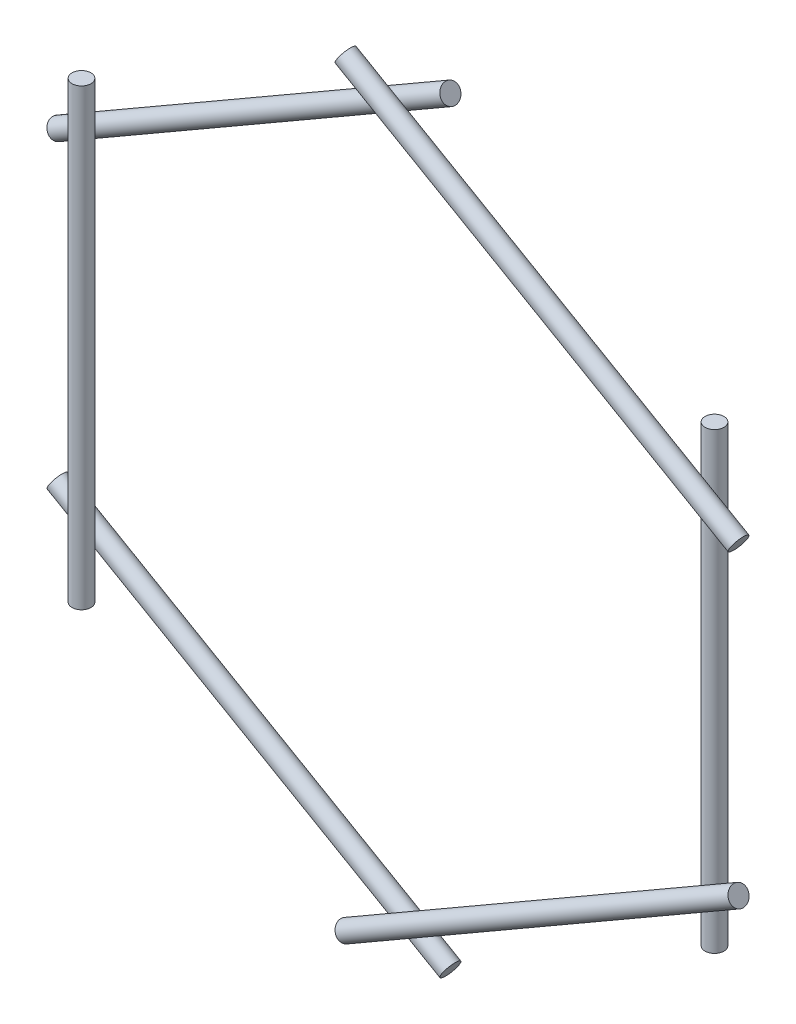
from build123d import *

# Parameters (mm, degrees)
SKETCH2_R             = 6.35
BOSS_EXTRUDE1_DEPTH   = 152.4
BOSS_EXTRUDE1_2_DEPTH = 152.4
SKETCH4_R             = 6.35
BOSS_EXTRUDE2_DEPTH   = 152.4
BOSS_EXTRUDE2_2_DEPTH = 152.4
SKETCH5_R             = 6.35
BOSS_EXTRUDE3_DEPTH   = 152.4
BOSS_EXTRUDE3_2_DEPTH = 152.4


with BuildPart() as part:
    # Sketch2 → Boss-Extrude1 (new, symmetric)
    with BuildSketch(Plane(origin=(0, 0, 0), x_dir=(-1, 0, 0), z_dir=(0, 1, 0))):
        with Locations(Location((-206.281536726, -6.35, 0), (0, 0, 270))):
            Circle(SKETCH2_R)
    extrude(amount=BOSS_EXTRUDE1_DEPTH, both=True)


with BuildPart() as body_2:
    # Sketch2 → Boss-Extrude1 2 (new, symmetric)
    with BuildSketch(Plane(origin=(0, 0, 0), x_dir=(-1, 0, 0), z_dir=(0, 1, 0))):
        with Locations(Location((206.281536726, 6.35, 0), (0, 0, 270))):
            Circle(SKETCH2_R)
    extrude(amount=BOSS_EXTRUDE1_2_DEPTH, both=True)


with BuildPart() as body_3:
    # Sketch4 → Boss-Extrude2 (new, symmetric)
    with BuildSketch(Plane(origin=(0, 0, 0), x_dir=(0, 0, 1), z_dir=(-0.8660254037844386, 0.4999999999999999, 0))):
        with Locations(Location((6.35, 206.281536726, 0), (0, 0, 270))):
            Circle(SKETCH4_R)
    extrude(amount=BOSS_EXTRUDE2_DEPTH, both=True)


with BuildPart() as body_4:
    # Sketch4 → Boss-Extrude2 2 (new, symmetric)
    with BuildSketch(Plane(origin=(0, 0, 0), x_dir=(0, 0, 1), z_dir=(-0.8660254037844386, 0.4999999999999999, 0))):
        with Locations(Location((-6.35, -206.281536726, 0), (0, 0, 270))):
            Circle(SKETCH4_R)
    extrude(amount=BOSS_EXTRUDE2_2_DEPTH, both=True)


with BuildPart() as body_5:
    # Sketch5 → Boss-Extrude3 (new, symmetric)
    with BuildSketch(Plane(origin=(0, 0, 0), x_dir=(0, 0, 1), z_dir=(-0.8660254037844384, -0.5000000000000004, 0))):
        with Locations(Location((-6.35, 206.281536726, 0), (0, 0, 270))):
            Circle(SKETCH5_R)
    extrude(amount=BOSS_EXTRUDE3_DEPTH, both=True)


with BuildPart() as body_6:
    # Sketch5 → Boss-Extrude3 2 (new, symmetric)
    with BuildSketch(Plane(origin=(0, 0, 0), x_dir=(0, 0, 1), z_dir=(-0.8660254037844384, -0.5000000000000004, 0))):
        with Locations(Location((6.35, -206.281536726, 0), (0, 0, 270))):
            Circle(SKETCH5_R)
    extrude(amount=BOSS_EXTRUDE3_2_DEPTH, both=True)


solid = Compound([part.part, body_2.part, body_3.part, body_4.part, body_5.part, body_6.part])
